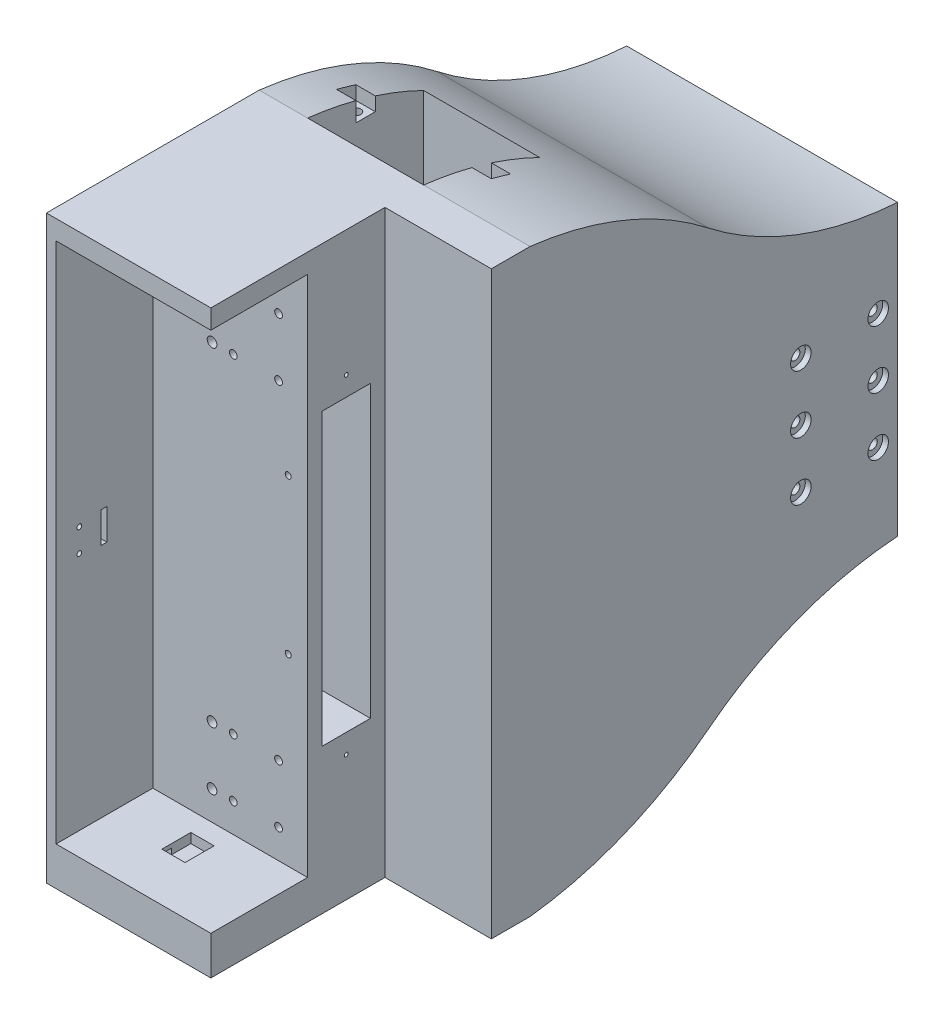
from build123d import *

# Parameters (mm, degrees)
EXTRUDE_1_DEPTH           = 300
SKETCH_3_W                = 50
SKETCH_3_H                = 280
CUT_EXTRUDE_1_DEPTH       = 80
SKETCH_5_R                = 2
CUT_EXTRUDE_2_DEPTH       = 50
SKETCH_9_R                = 2.5
CUT_EXTRUDE_3_DEPTH       = 50
SKETCH_11_W               = 140
SKETCH_11_H               = 300
SKETCH_11_R               = 2
SKETCH_11_R_2             = 2.5
EXTRUDE_3_DEPTH           = 10
SKETCH_12_W               = 55
SKETCH_12_H               = 300
CUT_EXTRUDE_4_DEPTH       = 10
EXTRUDE_4_DEPTH           = 140
CUT_EXTRUDE_START         = -85
CUT_EXTRUDE_5_DEPTH       = 60
SKETCH_16_W               = 25
SKETCH_16_H               = 75
CUT_EXTRUDE_6_DEPTH       = 60
SKETCH_17_W               = 100
SKETCH_17_H               = 89.5
CUT_EXTRUDE_8_DEPTH       = 61
CUT_EXTRUDE_9_DEPTH       = 381
CUT_EXTRUDE_9_DEPTH_BACK  = 381
SKETCH_19_R               = 2.5
CUT_EXTRUDE_10_DEPTH      = 387.781592
CUT_EXTRUDE_10_DEPTH_BACK = 3
SKETCH_20_R               = 5.3
SKETCH_20_R_2             = 2.5
CUT_EXTRUDE_START_2       = -3
SKETCH_21_R               = 5.3
CUT_EXTRUDE_11_DEPTH      = 3
SKETCH_22_W               = 35.5
SKETCH_22_H               = 35.5
CUT_EXTRUDE_12_DEPTH      = 71
SKETCH_23_W               = 20
SKETCH_23_H               = 10
CUT_EXTRUDE_13_DEPTH      = 2
SKETCH_24_W               = 3
SKETCH_24_H               = 16
CUT_EXTRUDE_14_DEPTH      = 12
SKETCH_25_R               = 1.25
CUT_EXTRUDE_15_DEPTH      = 12
SKETCH_26_W               = 80
SKETCH_26_H               = 50
EXTRUDE_5_DEPTH           = 10
CUT_EXTRUDE_16_DEPTH      = 18
CUT_EXTRUDE_17_DEPTH      = 10
SKETCH_30_W               = 12
SKETCH_30_H               = 10
CUT_EXTRUDE_18_DEPTH      = 5
SKETCH_31_R               = 1
CUT_EXTRUDE_19_DEPTH      = 20
SKETCH_32_R               = 1.55
CUT_EXTRUDE_20_DEPTH      = 20
CUT_EXTRUDE_START_3       = -95
CUT_EXTRUDE_21_DEPTH      = 80
SKETCH_34_R               = 2.5
CUT_EXTRUDE_22_DEPTH      = 20
CUT_EXTRUDE_START_4       = -20
SKETCH_35_R               = 2.5
CUT_EXTRUDE_23_DEPTH      = 20


with BuildPart() as part:
    # Sketch 1 → Extrude 1 (new body)
    with BuildSketch(Plane(origin=(0, 0, 0), x_dir=(1, 0, 0), z_dir=(0, 1, 0))):
        Polygon((0, 0), (140, 0), (140, -20), (85, -20), (85, -100), (0, -100), align=None)
    extrude(amount=EXTRUDE_1_DEPTH)

    # Sketch 3 → Cut-Extrude 1 (cut)
    with BuildSketch(Plane(origin=(85, 0, 0), x_dir=(0, 0, -1), z_dir=(1, 0, 0))):
        with Locations((-75, 150)):
            Rectangle(SKETCH_3_W, SKETCH_3_H)
    extrude(amount=-CUT_EXTRUDE_1_DEPTH, mode=Mode.SUBTRACT)

    # Sketch 5 → Cut-Extrude 2 (cut)
    with BuildSketch(Plane.XY.offset(50)):
        with Locations((46.6, 65)):
            Circle(SKETCH_5_R)
        with Locations((70, 65)):
            Circle(SKETCH_5_R)
        with Locations((46.6, 35)):
            Circle(SKETCH_5_R)
        with BuildLine():
            ThreePointArc((72, 35), (68.585786, 36.414214), (70, 33))
            Line((70, 33), (70, 35))
            Line((70, 35), (72, 35))
        make_face()
        with BuildLine():
            Line((70, 35), (70, 33))
            ThreePointArc((70, 33), (71.414214, 33.585786), (72, 35))
            Line((72, 35), (70, 35))
        make_face()
        with BuildLine():
            ThreePointArc((72, 35), (68.585786, 36.414214), (70, 33))
            Line((70, 33), (70, 35))
            Line((70, 35), (72, 35))
        make_face()
        with BuildLine():
            Line((70, 35), (70, 33))
            ThreePointArc((70, 33), (71.414214, 33.585786), (72, 35))
            Line((72, 35), (70, 35))
        make_face()
        with Locations((70, 235)):
            Circle(SKETCH_5_R)
        with Locations((46.6, 265)):
            Circle(SKETCH_5_R)
        with Locations((70, 265)):
            Circle(SKETCH_5_R)
        with Locations((46.6, 235)):
            Circle(SKETCH_5_R)
    extrude(amount=-CUT_EXTRUDE_2_DEPTH, mode=Mode.SUBTRACT)

    # Sketch 9 → Cut-Extrude 3 (cut)
    with BuildSketch(Plane.XY.offset(50)):
        with Locations((35.6, 265)):
            Circle(SKETCH_9_R)
        with Locations((35.6, 235)):
            Circle(SKETCH_9_R)
        with Locations((35.6, 65)):
            Circle(SKETCH_9_R)
        with Locations((35.6, 35)):
            Circle(SKETCH_9_R)
    extrude(amount=-CUT_EXTRUDE_3_DEPTH, mode=Mode.SUBTRACT)

    # Sketch 11 → Extrude 3 (add)
    with BuildSketch(Plane(origin=(0, 0, 0), x_dir=(-1, 0, 0), z_dir=(0, 0, -1))):
        with Locations((-70, 150)):
            Rectangle(SKETCH_11_W, SKETCH_11_H)
        with Locations(Location((-46.6, 235, 0), (0, 0, 180))):
            Circle(SKETCH_11_R, mode=Mode.SUBTRACT)
        with Locations(Location((-70, 265, 0), (0, 0, 180))):
            Circle(SKETCH_11_R, mode=Mode.SUBTRACT)
        with Locations(Location((-46.6, 265, 0), (0, 0, 180))):
            Circle(SKETCH_11_R, mode=Mode.SUBTRACT)
        with Locations(Location((-70, 235, 0), (0, 0, 180))):
            Circle(SKETCH_11_R, mode=Mode.SUBTRACT)
        with Locations(Location((-35.6, 235, 0), (0, 0, 180))):
            Circle(SKETCH_11_R_2, mode=Mode.SUBTRACT)
        with Locations(Location((-35.6, 265, 0), (0, 0, 180))):
            Circle(SKETCH_11_R_2, mode=Mode.SUBTRACT)
        with Locations(Location((-35.6, 35, 0), (0, 0, 180))):
            Circle(SKETCH_11_R_2, mode=Mode.SUBTRACT)
        with Locations(Location((-35.6, 65, 0), (0, 0, 180))):
            Circle(SKETCH_11_R_2, mode=Mode.SUBTRACT)
        with Locations(Location((-46.6, 65, 0), (0, 0, 180))):
            Circle(SKETCH_11_R, mode=Mode.SUBTRACT)
        with Locations(Location((-46.6, 35, 0), (0, 0, 180))):
            Circle(SKETCH_11_R, mode=Mode.SUBTRACT)
        with Locations(Location((-70, 35, 0), (0, 0, 180))):
            Circle(SKETCH_11_R, mode=Mode.SUBTRACT)
        with Locations(Location((-70, 65, 0), (0, 0, 180))):
            Circle(SKETCH_11_R, mode=Mode.SUBTRACT)
    extrude(amount=EXTRUDE_3_DEPTH)

    # Sketch 12 → Cut-Extrude 4 (cut)
    with BuildSketch(Plane.XY.offset(20)):
        with Locations((112.5, 150)):
            Rectangle(SKETCH_12_W, SKETCH_12_H)
    extrude(amount=-CUT_EXTRUDE_4_DEPTH, mode=Mode.SUBTRACT)

    # Sketch 13 → Extrude 4 (add)
    with BuildSketch(Plane(origin=(140, 0, 0), x_dir=(0, 0, -1), z_dir=(1, 0, 0))):
        with BuildLine():
            ThreePointArc((10, 0), (58.666858, 12.55861), (102.135592, 37.790552))
            ThreePointArc((102.135592, 37.790552), (148.265248, 63.842053), (200, 75.25))
            Line((200, 75.25), (200, 224.75))
            ThreePointArc((200, 224.75), (148.265248, 236.157947), (102.135592, 262.209448))
            ThreePointArc((102.135592, 262.209448), (58.666858, 287.44139), (10, 300))
            Line((10, 300), (10, 0))
        make_face()
    extrude(amount=-EXTRUDE_4_DEPTH)

    # Sketch 15 → Cut-Extrude 5 (cut)
    with BuildSketch(Plane.ZY.offset(CUT_EXTRUDE_START)):
        with BuildLine():
            ThreePointArc((-70, 17.659669), (-40.754105, 6.26771), (-10, 0))
            Line((-10, 0), (-10, 80))
            Line((-10, 80), (-70, 80))
            Line((-70, 80), (-70, 17.659669))
        make_face()
        with BuildLine():
            Line((-10, 220), (-10, 300))
            ThreePointArc((-10, 300), (-40.754105, 293.73229), (-70, 282.340331))
            Line((-70, 282.340331), (-70, 220))
            Line((-70, 220), (-10, 220))
        make_face()
    extrude(amount=CUT_EXTRUDE_5_DEPTH, mode=Mode.SUBTRACT)

    # Sketch 16 → Cut-Extrude 6 (cut)
    with BuildSketch(Plane(origin=(85, 0, 0), x_dir=(0, 0, -1), z_dir=(1, 0, 0))):
        with Locations((-30, 187.5)):
            Rectangle(SKETCH_16_W, SKETCH_16_H)
        with Locations((-30, 112.5)):
            Rectangle(SKETCH_16_W, SKETCH_16_H)
    extrude(amount=-CUT_EXTRUDE_6_DEPTH, mode=Mode.SUBTRACT)

    # Sketch 17 → Cut-Extrude 8 (cut)
    with BuildSketch(Plane(origin=(0, 0, -200), x_dir=(-1, 0, 0), z_dir=(0, 0, -1))):
        with Locations((-70, 150)):
            Rectangle(SKETCH_17_W, SKETCH_17_H)
    extrude(amount=-CUT_EXTRUDE_8_DEPTH, mode=Mode.SUBTRACT)

    # Sketch 19 → Cut-Extrude 9 (cut, two sides: drawn at the far end of the back side and taken through both)
    with BuildSketch(Plane(origin=(20, 0, 0), x_dir=(0, 0, -1), z_dir=(1, 0, 0)).offset(-CUT_EXTRUDE_9_DEPTH_BACK)):
        with Locations(Location((190, 150, 0), (0, 0, 90))):
            Circle(SKETCH_19_R)
        with Locations(Location((150, 150, 0), (0, 0, 90))):
            Circle(SKETCH_19_R)
        with Locations(Location((150, 180, 0), (0, 0, 90))):
            Circle(SKETCH_19_R)
        with Locations(Location((190, 180, 0), (0, 0, 90))):
            Circle(SKETCH_19_R)
        with Locations(Location((150, 120, 0), (0, 0, 90))):
            Circle(SKETCH_19_R)
        with Locations(Location((190, 120, 0), (0, 0, 90))):
            Circle(SKETCH_19_R)
    extrude(amount=CUT_EXTRUDE_9_DEPTH + CUT_EXTRUDE_9_DEPTH_BACK, mode=Mode.SUBTRACT)

    # Sketch 20 → Cut-Extrude 10 (cut, two sides: drawn at the far end of the back side and taken through both)
    # profile 1 of 6: a face of its own
    with BuildSketch(Plane(origin=(140, 0, 0), x_dir=(0, 0, -1), z_dir=(1, 0, 0)).offset(-CUT_EXTRUDE_10_DEPTH_BACK)):
        with Locations(Location((190, 180, 0), (0, 0, 180))):
            Circle(SKETCH_20_R)
        with Locations(Location((190, 180, 0), (0, 0, 90))):
            Circle(SKETCH_20_R_2, mode=Mode.SUBTRACT)
    # profile 2 of 6: a face of its own
    with BuildSketch(Plane(origin=(140, 0, 0), x_dir=(0, 0, -1), z_dir=(1, 0, 0)).offset(-CUT_EXTRUDE_10_DEPTH_BACK)):
        with Locations(Location((150, 180, 0), (0, 0, 180))):
            Circle(SKETCH_20_R)
        with Locations(Location((150, 180, 0), (0, 0, 90))):
            Circle(SKETCH_20_R_2, mode=Mode.SUBTRACT)
    # profile 3 of 6: a face of its own
    with BuildSketch(Plane(origin=(140, 0, 0), x_dir=(0, 0, -1), z_dir=(1, 0, 0)).offset(-CUT_EXTRUDE_10_DEPTH_BACK)):
        with Locations(Location((150, 150, 0), (0, 0, 180))):
            Circle(SKETCH_20_R)
        with Locations(Location((150, 150, 0), (0, 0, 90))):
            Circle(SKETCH_20_R_2, mode=Mode.SUBTRACT)
    # profile 4 of 6: a face of its own
    with BuildSketch(Plane(origin=(140, 0, 0), x_dir=(0, 0, -1), z_dir=(1, 0, 0)).offset(-CUT_EXTRUDE_10_DEPTH_BACK)):
        with Locations(Location((190, 150, 0), (0, 0, 180))):
            Circle(SKETCH_20_R)
        with Locations(Location((190, 150, 0), (0, 0, 90))):
            Circle(SKETCH_20_R_2, mode=Mode.SUBTRACT)
    # profile 5 of 6: a face of its own
    with BuildSketch(Plane(origin=(140, 0, 0), x_dir=(0, 0, -1), z_dir=(1, 0, 0)).offset(-CUT_EXTRUDE_10_DEPTH_BACK)):
        with Locations(Location((190, 120, 0), (0, 0, 180))):
            Circle(SKETCH_20_R)
        with Locations(Location((190, 120, 0), (0, 0, 90))):
            Circle(SKETCH_20_R_2, mode=Mode.SUBTRACT)
    # profile 6 of 6: a face of its own
    with BuildSketch(Plane(origin=(140, 0, 0), x_dir=(0, 0, -1), z_dir=(1, 0, 0)).offset(-CUT_EXTRUDE_10_DEPTH_BACK)):
        with Locations(Location((150, 120, 0), (0, 0, 180))):
            Circle(SKETCH_20_R)
        with Locations(Location((150, 120, 0), (0, 0, 90))):
            Circle(SKETCH_20_R_2, mode=Mode.SUBTRACT)
    extrude(amount=CUT_EXTRUDE_10_DEPTH + CUT_EXTRUDE_10_DEPTH_BACK, mode=Mode.SUBTRACT)

    # Sketch 21 → Cut-Extrude 11 (cut)
    with BuildSketch(Plane.ZY.offset(CUT_EXTRUDE_START_2)):
        with Locations((-150, 150)):
            Circle(SKETCH_21_R)
        with Locations((-150, 120)):
            Circle(SKETCH_21_R)
        with Locations((-150, 180)):
            Circle(SKETCH_21_R)
        with Locations((-190, 180)):
            Circle(SKETCH_21_R)
        with Locations((-190, 150)):
            Circle(SKETCH_21_R)
        with Locations((-190, 120)):
            Circle(SKETCH_21_R)
    extrude(amount=CUT_EXTRUDE_11_DEPTH, mode=Mode.SUBTRACT)

    # Sketch 22 → Cut-Extrude 12 (cut)
    with BuildSketch(Plane(origin=(0, 0, -139), x_dir=(-1, 0, 0), z_dir=(0, 0, -1))):
        with Locations((-87.75, 167.75)):
            Rectangle(SKETCH_22_W, SKETCH_22_H)
        with Locations((-52.25, 167.75)):
            Rectangle(SKETCH_22_W, SKETCH_22_H)
        with Locations((-52.25, 132.25)):
            Rectangle(SKETCH_22_W, SKETCH_22_H)
        with Locations((-87.75, 132.25)):
            Rectangle(SKETCH_22_W, SKETCH_22_H)
    extrude(amount=-CUT_EXTRUDE_12_DEPTH, mode=Mode.SUBTRACT)

    # Sketch 23 → Cut-Extrude 13 (cut)
    with BuildSketch(Plane.ZY):
        with Locations((80, 145)):
            Rectangle(SKETCH_23_W, SKETCH_23_H)
        with Locations((80, 155)):
            Rectangle(SKETCH_23_W, SKETCH_23_H)
    extrude(amount=-CUT_EXTRUDE_13_DEPTH, mode=Mode.SUBTRACT)

    # Sketch 24 → Cut-Extrude 14 (cut)
    with BuildSketch(Plane.ZY.offset(-2)):
        with Locations((75.25, 150)):
            Rectangle(SKETCH_24_W, SKETCH_24_H)
    extrude(amount=-CUT_EXTRUDE_14_DEPTH, mode=Mode.SUBTRACT)

    # Sketch 25 → Cut-Extrude 15 (cut)
    with BuildSketch(Plane.ZY.offset(-2)):
        with Locations((88, 156)):
            Circle(SKETCH_25_R)
        with Locations((88, 144)):
            Circle(SKETCH_25_R)
    extrude(amount=-CUT_EXTRUDE_15_DEPTH, mode=Mode.SUBTRACT)

    # Sketch 26 → Extrude 5 (add)
    with BuildSketch(Plane(origin=(0, 10, 0), x_dir=(1, 0, 0), z_dir=(0, 1, 0))):
        with Locations((45, -75)):
            Rectangle(SKETCH_26_W, SKETCH_26_H)
    extrude(amount=EXTRUDE_5_DEPTH)

    # Sketch 28 → Cut-Extrude 16 (cut)
    with BuildSketch(Plane.XZ):
        Polygon((63.662122, 70), (63.662122, 91), (40.662122, 91), (17.662122, 91), (17.662122, 70), align=None)
    extrude(amount=-CUT_EXTRUDE_16_DEPTH, mode=Mode.SUBTRACT)

    # Sketch 29 → Cut-Extrude 17 (cut)
    with BuildSketch(Plane.XZ.offset(-18)):
        Polygon((34.662122, 70), (40.662122, 70), (46.662122, 70), (46.662122, 75), (34.662122, 75), align=None)
    extrude(amount=-CUT_EXTRUDE_17_DEPTH, mode=Mode.SUBTRACT)

    # Sketch 30 → Cut-Extrude 18 (cut)
    with BuildSketch(Plane(origin=(0, 20, 0), x_dir=(1, 0, 0), z_dir=(0, 1, 0))):
        with Locations((40.662122, -65)):
            Rectangle(SKETCH_30_W, SKETCH_30_H)
    extrude(amount=-CUT_EXTRUDE_18_DEPTH, mode=Mode.SUBTRACT)

    # Sketch 31 → Cut-Extrude 19 (cut)
    with BuildSketch(Plane(origin=(85, 0, 0), x_dir=(0, 0, -1), z_dir=(1, 0, 0))):
        with Locations((-30, 235)):
            Circle(SKETCH_31_R)
        with Locations((-30, 65)):
            Circle(SKETCH_31_R)
    extrude(amount=-CUT_EXTRUDE_19_DEPTH, mode=Mode.SUBTRACT)

    # Sketch 32 → Cut-Extrude 20 (cut)
    with BuildSketch(Plane.XY.offset(50)):
        with Locations((75, 195)):
            Circle(SKETCH_32_R)
        with Locations(Location((75, 115, 0), (0, 0, 180))):
            Circle(SKETCH_32_R)
    extrude(amount=-CUT_EXTRUDE_20_DEPTH, mode=Mode.SUBTRACT)

    # Sketch 33 → Cut-Extrude 21 (cut)
    with BuildSketch(Plane.ZY.offset(CUT_EXTRUDE_START_3)):
        with BuildLine():
            Line((-45, 285.325139), (-35, 285.325139))
            Line((-35, 285.325139), (-35, 295.325139))
            ThreePointArc((-35, 295.325139), (-40.020457, 293.946572), (-45, 292.426839))
            Line((-45, 292.426839), (-45, 285.325139))
        make_face()
        with BuildLine():
            ThreePointArc((-45, 7.573161), (-40.020457, 6.053428), (-35, 4.674861))
            Line((-35, 4.674861), (-35, 14.674861))
            Line((-35, 14.674861), (-45, 14.674861))
            Line((-45, 14.674861), (-45, 7.573161))
        make_face()
    extrude(amount=CUT_EXTRUDE_21_DEPTH, mode=Mode.SUBTRACT)

    # Sketch 34 → Cut-Extrude 22 (cut)
    with BuildSketch(Plane.XZ.offset(-14.674861)):
        with Locations(Location((20, -40, 0), (0, 0, 270))):
            Circle(SKETCH_34_R)
        with Locations(Location((90, -40, 0), (0, 0, 90))):
            Circle(SKETCH_34_R)
    extrude(amount=-CUT_EXTRUDE_22_DEPTH, mode=Mode.SUBTRACT)

    # Sketch 35 → Cut-Extrude 23 (cut)
    with BuildSketch(Plane(origin=(0, 285.325139, 0), x_dir=(1, 0, 0), z_dir=(0, 1, 0)).offset(CUT_EXTRUDE_START_4)):
        with Locations(Location((90, 40, 0), (0, 0, 270))):
            Circle(SKETCH_35_R)
        with Locations(Location((20, 40, 0), (0, 0, 90))):
            Circle(SKETCH_35_R)
    extrude(amount=CUT_EXTRUDE_23_DEPTH, mode=Mode.SUBTRACT)


solid = part.part
